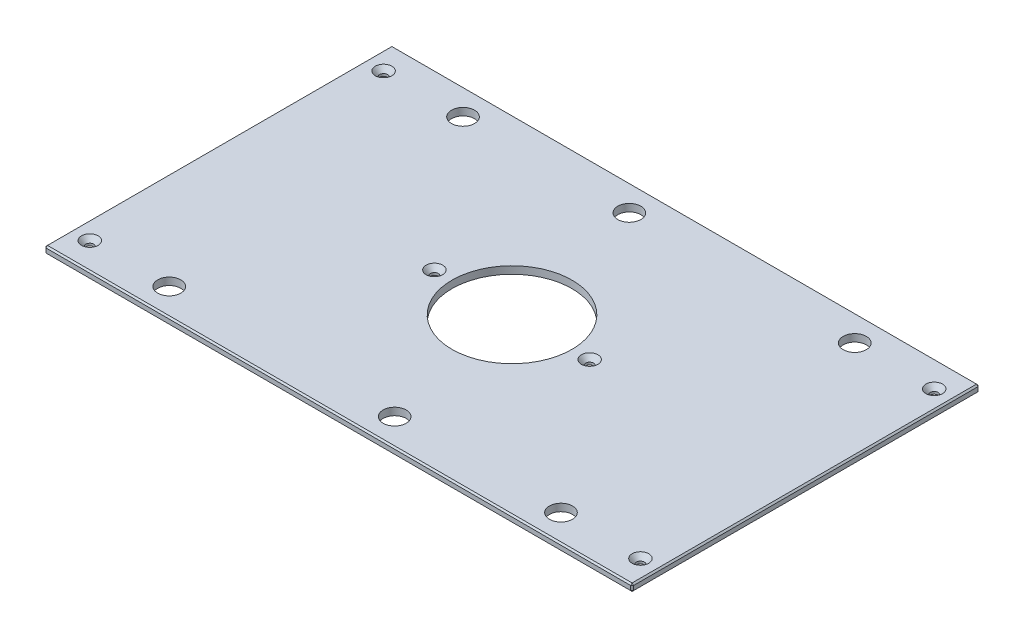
ISO-10303-21;
HEADER;
FILE_DESCRIPTION(('STEP AP214'),'2;1');
FILE_NAME('part.step','',(''),(''),'','','');
FILE_SCHEMA(('AUTOMOTIVE_DESIGN { 1 0 10303 214 1 1 1 1 }'));
ENDSEC;
DATA;
#1=APPLICATION_CONTEXT('core data for automotive mechanical design processes');
#2=APPLICATION_PROTOCOL_DEFINITION('international standard','automotive_design',2000,#1);
#3=PRODUCT_CONTEXT('',#1,'mechanical');
#4=PRODUCT('Part','Part','',(#3));
#5=PRODUCT_RELATED_PRODUCT_CATEGORY('part','',(#4));
#6=PRODUCT_DEFINITION_FORMATION('','',#4);
#7=PRODUCT_DEFINITION_CONTEXT('part definition',#1,'design');
#8=PRODUCT_DEFINITION('design','',#6,#7);
#9=PRODUCT_DEFINITION_SHAPE('','',#8);
#10=(LENGTH_UNIT() NAMED_UNIT(*) SI_UNIT(.MILLI.,.METRE.));
#11=(NAMED_UNIT(*) PLANE_ANGLE_UNIT() SI_UNIT($,.RADIAN.));
#12=(NAMED_UNIT(*) SI_UNIT($,.STERADIAN.) SOLID_ANGLE_UNIT());
#13=UNCERTAINTY_MEASURE_WITH_UNIT(LENGTH_MEASURE(1.E-05),#10,'distance_accuracy_value','');
#14=(GEOMETRIC_REPRESENTATION_CONTEXT(3) GLOBAL_UNCERTAINTY_ASSIGNED_CONTEXT((#13)) GLOBAL_UNIT_ASSIGNED_CONTEXT((#10,
#11,#12)) REPRESENTATION_CONTEXT('',''));
#15=CARTESIAN_POINT('',(0.,0.,0.));
#16=DIRECTION('',(0.,0.,1.));
#17=DIRECTION('',(1.,0.,0.));
#18=AXIS2_PLACEMENT_3D('',#15,#16,#17);
#19=CARTESIAN_POINT('',(-252.4125,6.35,-149.225));
#20=DIRECTION('',(1.,0.,0.));
#21=DIRECTION('',(0.,0.,-1.));
#22=AXIS2_PLACEMENT_3D('',#19,#20,#21);
#23=PLANE('',#22);
#24=DIRECTION('',(0.,0.,-1.));
#25=VECTOR('',#24,1.);
#26=CARTESIAN_POINT('',(-252.4125,5.08000000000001,-149.225));
#27=LINE('',#26,#25);
#28=CARTESIAN_POINT('',(-252.4125,5.08000000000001,147.955));
#29=VERTEX_POINT('',#28);
#30=CARTESIAN_POINT('',(-252.4125,5.08000000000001,-147.955));
#31=VERTEX_POINT('',#30);
#32=EDGE_CURVE('E140',#29,#31,#27,.T.);
#33=ORIENTED_EDGE('',*,*,#32,.T.);
#34=DIRECTION('',(0.,-1.,0.));
#35=VECTOR('',#34,1.);
#36=CARTESIAN_POINT('',(-252.4125,6.35,-147.955));
#37=LINE('',#36,#35);
#38=CARTESIAN_POINT('',(-252.4125,1.26999999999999,-147.955));
#39=VERTEX_POINT('',#38);
#40=EDGE_CURVE('E135',#31,#39,#37,.T.);
#41=ORIENTED_EDGE('',*,*,#40,.T.);
#42=DIRECTION('',(0.,0.,1.));
#43=VECTOR('',#42,1.);
#44=CARTESIAN_POINT('',(-252.4125,1.26999999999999,-149.225));
#45=LINE('',#44,#43);
#46=CARTESIAN_POINT('',(-252.4125,1.26999999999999,147.955));
#47=VERTEX_POINT('',#46);
#48=EDGE_CURVE('E130',#39,#47,#45,.T.);
#49=ORIENTED_EDGE('',*,*,#48,.T.);
#50=DIRECTION('',(0.,1.,0.));
#51=VECTOR('',#50,1.);
#52=CARTESIAN_POINT('',(-252.4125,6.35,147.955));
#53=LINE('',#52,#51);
#54=EDGE_CURVE('E132',#47,#29,#53,.T.);
#55=ORIENTED_EDGE('',*,*,#54,.T.);
#56=EDGE_LOOP('',(#33,#41,#49,#55));
#57=FACE_BOUND('',#56,.T.);
#58=ADVANCED_FACE('F38',(#57),#23,.F.);
#59=CARTESIAN_POINT('',(-252.4125,6.35,149.225));
#60=DIRECTION('',(0.,0.,-1.));
#61=DIRECTION('',(-1.,0.,0.));
#62=AXIS2_PLACEMENT_3D('',#59,#60,#61);
#63=PLANE('',#62);
#64=DIRECTION('',(1.,0.,0.));
#65=VECTOR('',#64,1.);
#66=CARTESIAN_POINT('',(-252.4125,1.27000000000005,149.225));
#67=LINE('',#66,#65);
#68=CARTESIAN_POINT('',(-251.1425,1.27000000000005,149.225));
#69=VERTEX_POINT('',#68);
#70=CARTESIAN_POINT('',(251.1425,1.27000000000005,149.225));
#71=VERTEX_POINT('',#70);
#72=EDGE_CURVE('E62',#69,#71,#67,.T.);
#73=ORIENTED_EDGE('',*,*,#72,.T.);
#74=DIRECTION('',(0.,1.,0.));
#75=VECTOR('',#74,1.);
#76=CARTESIAN_POINT('',(251.1425,6.35,149.225));
#77=LINE('',#76,#75);
#78=CARTESIAN_POINT('',(251.1425,5.07999999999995,149.225));
#79=VERTEX_POINT('',#78);
#80=EDGE_CURVE('E11',#71,#79,#77,.T.);
#81=ORIENTED_EDGE('',*,*,#80,.T.);
#82=DIRECTION('',(-1.,0.,0.));
#83=VECTOR('',#82,1.);
#84=CARTESIAN_POINT('',(-252.4125,5.07999999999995,149.225));
#85=LINE('',#84,#83);
#86=CARTESIAN_POINT('',(-251.1425,5.07999999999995,149.225));
#87=VERTEX_POINT('',#86);
#88=EDGE_CURVE('E48',#79,#87,#85,.T.);
#89=ORIENTED_EDGE('',*,*,#88,.T.);
#90=DIRECTION('',(0.,-1.,0.));
#91=VECTOR('',#90,1.);
#92=CARTESIAN_POINT('',(-251.1425,6.35,149.225));
#93=LINE('',#92,#91);
#94=EDGE_CURVE('E350',#87,#69,#93,.T.);
#95=ORIENTED_EDGE('',*,*,#94,.T.);
#96=EDGE_LOOP('',(#73,#81,#89,#95));
#97=FACE_BOUND('',#96,.T.);
#98=ADVANCED_FACE('F427',(#97),#63,.F.);
#99=CARTESIAN_POINT('',(252.4125,6.35,-149.225));
#100=DIRECTION('',(-1.,0.,0.));
#101=DIRECTION('',(0.,0.,1.));
#102=AXIS2_PLACEMENT_3D('',#99,#100,#101);
#103=PLANE('',#102);
#104=DIRECTION('',(0.,0.,-1.));
#105=VECTOR('',#104,1.);
#106=CARTESIAN_POINT('',(252.4125,1.27000000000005,-149.225));
#107=LINE('',#106,#105);
#108=CARTESIAN_POINT('',(252.4125,1.27000000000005,147.955));
#109=VERTEX_POINT('',#108);
#110=CARTESIAN_POINT('',(252.4125,1.27000000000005,-147.955));
#111=VERTEX_POINT('',#110);
#112=EDGE_CURVE('E343',#109,#111,#107,.T.);
#113=ORIENTED_EDGE('',*,*,#112,.T.);
#114=DIRECTION('',(0.,1.,0.));
#115=VECTOR('',#114,1.);
#116=CARTESIAN_POINT('',(252.4125,6.35,-147.955));
#117=LINE('',#116,#115);
#118=CARTESIAN_POINT('',(252.4125,5.08000000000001,-147.955));
#119=VERTEX_POINT('',#118);
#120=EDGE_CURVE('E346',#111,#119,#117,.T.);
#121=ORIENTED_EDGE('',*,*,#120,.T.);
#122=DIRECTION('',(0.,0.,1.));
#123=VECTOR('',#122,1.);
#124=CARTESIAN_POINT('',(252.4125,5.08000000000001,149.225));
#125=LINE('',#124,#123);
#126=CARTESIAN_POINT('',(252.4125,5.08000000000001,147.955));
#127=VERTEX_POINT('',#126);
#128=EDGE_CURVE('E340',#119,#127,#125,.T.);
#129=ORIENTED_EDGE('',*,*,#128,.T.);
#130=DIRECTION('',(0.,-1.,0.));
#131=VECTOR('',#130,1.);
#132=CARTESIAN_POINT('',(252.4125,6.35,147.955));
#133=LINE('',#132,#131);
#134=EDGE_CURVE('E337',#127,#109,#133,.T.);
#135=ORIENTED_EDGE('',*,*,#134,.T.);
#136=EDGE_LOOP('',(#113,#121,#129,#135));
#137=FACE_BOUND('',#136,.T.);
#138=ADVANCED_FACE('F414',(#137),#103,.F.);
#139=CARTESIAN_POINT('',(-252.4125,6.35,-149.225));
#140=DIRECTION('',(0.,0.,1.));
#141=DIRECTION('',(1.,0.,0.));
#142=AXIS2_PLACEMENT_3D('',#139,#140,#141);
#143=PLANE('',#142);
#144=DIRECTION('',(-1.,0.,0.));
#145=VECTOR('',#144,1.);
#146=CARTESIAN_POINT('',(-252.4125,1.27000000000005,-149.225));
#147=LINE('',#146,#145);
#148=CARTESIAN_POINT('',(251.1425,1.27000000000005,-149.225));
#149=VERTEX_POINT('',#148);
#150=CARTESIAN_POINT('',(-251.1425,1.27000000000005,-149.225));
#151=VERTEX_POINT('',#150);
#152=EDGE_CURVE('E303',#149,#151,#147,.T.);
#153=ORIENTED_EDGE('',*,*,#152,.T.);
#154=DIRECTION('',(0.,1.,0.));
#155=VECTOR('',#154,1.);
#156=CARTESIAN_POINT('',(-251.1425,6.35,-149.225));
#157=LINE('',#156,#155);
#158=CARTESIAN_POINT('',(-251.1425,5.08000000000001,-149.225));
#159=VERTEX_POINT('',#158);
#160=EDGE_CURVE('E309',#151,#159,#157,.T.);
#161=ORIENTED_EDGE('',*,*,#160,.T.);
#162=DIRECTION('',(1.,0.,0.));
#163=VECTOR('',#162,1.);
#164=CARTESIAN_POINT('',(252.4125,5.08000000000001,-149.225));
#165=LINE('',#164,#163);
#166=CARTESIAN_POINT('',(251.1425,5.08000000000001,-149.225));
#167=VERTEX_POINT('',#166);
#168=EDGE_CURVE('E306',#159,#167,#165,.T.);
#169=ORIENTED_EDGE('',*,*,#168,.T.);
#170=DIRECTION('',(0.,-1.,0.));
#171=VECTOR('',#170,1.);
#172=CARTESIAN_POINT('',(251.1425,6.35,-149.225));
#173=LINE('',#172,#171);
#174=EDGE_CURVE('E300',#167,#149,#173,.T.);
#175=ORIENTED_EDGE('',*,*,#174,.T.);
#176=EDGE_LOOP('',(#153,#161,#169,#175));
#177=FACE_BOUND('',#176,.T.);
#178=ADVANCED_FACE('F388',(#177),#143,.F.);
#179=CARTESIAN_POINT('',(0.,6.35,0.));
#180=DIRECTION('',(0.,1.,0.));
#181=DIRECTION('',(0.,0.,1.));
#182=AXIS2_PLACEMENT_3D('',#179,#180,#181);
#183=PLANE('',#182);
#184=CARTESIAN_POINT('',(236.5375,6.35,-126.20498));
#185=DIRECTION('',(0.,1.,0.));
#186=DIRECTION('',(0.,0.,1.));
#187=AXIS2_PLACEMENT_3D('',#184,#185,#186);
#188=CIRCLE('',#187,7.13739999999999);
#189=CARTESIAN_POINT('',(236.5375,6.35,-119.06758));
#190=VERTEX_POINT('',#189);
#191=EDGE_CURVE('E927',#190,#190,#188,.T.);
#192=ORIENTED_EDGE('',*,*,#191,.F.);
#193=EDGE_LOOP('',(#192));
#194=FACE_BOUND('',#193,.T.);
#195=CARTESIAN_POINT('',(236.5375,6.35,126.20498));
#196=DIRECTION('',(0.,1.,0.));
#197=DIRECTION('',(0.,0.,1.));
#198=AXIS2_PLACEMENT_3D('',#195,#196,#197);
#199=CIRCLE('',#198,7.13739999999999);
#200=CARTESIAN_POINT('',(236.5375,6.35,133.34238));
#201=VERTEX_POINT('',#200);
#202=EDGE_CURVE('E931',#201,#201,#199,.T.);
#203=ORIENTED_EDGE('',*,*,#202,.F.);
#204=EDGE_LOOP('',(#203));
#205=FACE_BOUND('',#204,.T.);
#206=CARTESIAN_POINT('',(-236.5375,6.35,126.20498));
#207=DIRECTION('',(0.,1.,0.));
#208=DIRECTION('',(0.,0.,1.));
#209=AXIS2_PLACEMENT_3D('',#206,#207,#208);
#210=CIRCLE('',#209,7.13739999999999);
#211=CARTESIAN_POINT('',(-236.5375,6.35,133.34238));
#212=VERTEX_POINT('',#211);
#213=EDGE_CURVE('E935',#212,#212,#210,.T.);
#214=ORIENTED_EDGE('',*,*,#213,.F.);
#215=EDGE_LOOP('',(#214));
#216=FACE_BOUND('',#215,.T.);
#217=CARTESIAN_POINT('',(-66.675,6.35,0.));
#218=DIRECTION('',(0.,1.,0.));
#219=DIRECTION('',(0.,0.,1.));
#220=AXIS2_PLACEMENT_3D('',#217,#218,#219);
#221=CIRCLE('',#220,7.1374);
#222=CARTESIAN_POINT('',(-66.675,6.35,7.1374));
#223=VERTEX_POINT('',#222);
#224=EDGE_CURVE('E939',#223,#223,#221,.T.);
#225=ORIENTED_EDGE('',*,*,#224,.F.);
#226=EDGE_LOOP('',(#225));
#227=FACE_BOUND('',#226,.T.);
#228=CARTESIAN_POINT('',(66.675,6.35,0.));
#229=DIRECTION('',(0.,1.,0.));
#230=DIRECTION('',(0.,0.,1.));
#231=AXIS2_PLACEMENT_3D('',#228,#229,#230);
#232=CIRCLE('',#231,7.1374);
#233=CARTESIAN_POINT('',(66.675,6.35,7.1374));
#234=VERTEX_POINT('',#233);
#235=EDGE_CURVE('E943',#234,#234,#232,.T.);
#236=ORIENTED_EDGE('',*,*,#235,.F.);
#237=EDGE_LOOP('',(#236));
#238=FACE_BOUND('',#237,.T.);
#239=CARTESIAN_POINT('',(-236.5375,6.35,-126.20498));
#240=DIRECTION('',(0.,1.,0.));
#241=DIRECTION('',(0.,0.,1.));
#242=AXIS2_PLACEMENT_3D('',#239,#240,#241);
#243=CIRCLE('',#242,7.13739999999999);
#244=CARTESIAN_POINT('',(-236.5375,6.35,-119.06758));
#245=VERTEX_POINT('',#244);
#246=EDGE_CURVE('E946',#245,#245,#243,.T.);
#247=ORIENTED_EDGE('',*,*,#246,.F.);
#248=EDGE_LOOP('',(#247));
#249=FACE_BOUND('',#248,.T.);
#250=DIRECTION('',(0.,0.,-1.));
#251=VECTOR('',#250,1.);
#252=CARTESIAN_POINT('',(251.1425,6.35,-149.225));
#253=LINE('',#252,#251);
#254=CARTESIAN_POINT('',(251.1425,6.35,147.955));
#255=VERTEX_POINT('',#254);
#256=CARTESIAN_POINT('',(251.1425,6.35,-147.955));
#257=VERTEX_POINT('',#256);
#258=EDGE_CURVE('E319',#255,#257,#253,.T.);
#259=ORIENTED_EDGE('',*,*,#258,.T.);
#260=DIRECTION('',(-1.,0.,0.));
#261=VECTOR('',#260,1.);
#262=CARTESIAN_POINT('',(-252.4125,6.35,-147.955));
#263=LINE('',#262,#261);
#264=CARTESIAN_POINT('',(-251.1425,6.35,-147.955));
#265=VERTEX_POINT('',#264);
#266=EDGE_CURVE('E322',#257,#265,#263,.T.);
#267=ORIENTED_EDGE('',*,*,#266,.T.);
#268=DIRECTION('',(0.,0.,1.));
#269=VECTOR('',#268,1.);
#270=CARTESIAN_POINT('',(-251.1425,6.35,149.225));
#271=LINE('',#270,#269);
#272=CARTESIAN_POINT('',(-251.1425,6.35,147.955));
#273=VERTEX_POINT('',#272);
#274=EDGE_CURVE('E316',#265,#273,#271,.T.);
#275=ORIENTED_EDGE('',*,*,#274,.T.);
#276=DIRECTION('',(1.,0.,0.));
#277=VECTOR('',#276,1.);
#278=CARTESIAN_POINT('',(252.4125,6.35,147.955));
#279=LINE('',#278,#277);
#280=EDGE_CURVE('E313',#273,#255,#279,.T.);
#281=ORIENTED_EDGE('',*,*,#280,.T.);
#282=EDGE_LOOP('',(#259,#267,#275,#281));
#283=FACE_BOUND('',#282,.T.);
#284=CARTESIAN_POINT('',(168.275,6.35,-126.20498));
#285=DIRECTION('',(0.,1.,0.));
#286=DIRECTION('',(0.,0.,1.));
#287=AXIS2_PLACEMENT_3D('',#284,#285,#286);
#288=CIRCLE('',#287,9.921875);
#289=CARTESIAN_POINT('',(168.275,6.35,-116.283105));
#290=VERTEX_POINT('',#289);
#291=EDGE_CURVE('E231',#290,#290,#288,.T.);
#292=ORIENTED_EDGE('',*,*,#291,.F.);
#293=EDGE_LOOP('',(#292));
#294=FACE_BOUND('',#293,.T.);
#295=CARTESIAN_POINT('',(-168.275,6.35,-126.20498));
#296=DIRECTION('',(0.,1.,0.));
#297=DIRECTION('',(0.,0.,1.));
#298=AXIS2_PLACEMENT_3D('',#295,#296,#297);
#299=CIRCLE('',#298,9.921875);
#300=CARTESIAN_POINT('',(-168.275,6.35,-116.283105));
#301=VERTEX_POINT('',#300);
#302=EDGE_CURVE('E244',#301,#301,#299,.T.);
#303=ORIENTED_EDGE('',*,*,#302,.F.);
#304=EDGE_LOOP('',(#303));
#305=FACE_BOUND('',#304,.T.);
#306=CARTESIAN_POINT('',(168.275,6.35,126.20498));
#307=DIRECTION('',(0.,1.,0.));
#308=DIRECTION('',(0.,0.,1.));
#309=AXIS2_PLACEMENT_3D('',#306,#307,#308);
#310=CIRCLE('',#309,9.921875);
#311=CARTESIAN_POINT('',(168.275,6.35,136.126855));
#312=VERTEX_POINT('',#311);
#313=EDGE_CURVE('E257',#312,#312,#310,.T.);
#314=ORIENTED_EDGE('',*,*,#313,.F.);
#315=EDGE_LOOP('',(#314));
#316=FACE_BOUND('',#315,.T.);
#317=CARTESIAN_POINT('',(-168.275,6.35,126.20498));
#318=DIRECTION('',(0.,1.,0.));
#319=DIRECTION('',(0.,0.,1.));
#320=AXIS2_PLACEMENT_3D('',#317,#318,#319);
#321=CIRCLE('',#320,9.921875);
#322=CARTESIAN_POINT('',(-168.275,6.35,136.126855));
#323=VERTEX_POINT('',#322);
#324=EDGE_CURVE('E265',#323,#323,#321,.T.);
#325=ORIENTED_EDGE('',*,*,#324,.F.);
#326=EDGE_LOOP('',(#325));
#327=FACE_BOUND('',#326,.T.);
#328=CARTESIAN_POINT('',(-25.4,6.35,-126.20498));
#329=DIRECTION('',(0.,1.,0.));
#330=DIRECTION('',(0.,0.,1.));
#331=AXIS2_PLACEMENT_3D('',#328,#329,#330);
#332=CIRCLE('',#331,9.921875);
#333=CARTESIAN_POINT('',(-25.4,6.35,-116.283105));
#334=VERTEX_POINT('',#333);
#335=EDGE_CURVE('E273',#334,#334,#332,.T.);
#336=ORIENTED_EDGE('',*,*,#335,.F.);
#337=EDGE_LOOP('',(#336));
#338=FACE_BOUND('',#337,.T.);
#339=CARTESIAN_POINT('',(25.4,6.35,126.20498));
#340=DIRECTION('',(0.,1.,0.));
#341=DIRECTION('',(0.,0.,1.));
#342=AXIS2_PLACEMENT_3D('',#339,#340,#341);
#343=CIRCLE('',#342,9.921875);
#344=CARTESIAN_POINT('',(25.4,6.35,136.126855));
#345=VERTEX_POINT('',#344);
#346=EDGE_CURVE('E281',#345,#345,#343,.T.);
#347=ORIENTED_EDGE('',*,*,#346,.F.);
#348=EDGE_LOOP('',(#347));
#349=FACE_BOUND('',#348,.T.);
#350=CARTESIAN_POINT('',(0.,6.35,0.));
#351=DIRECTION('',(0.,1.,0.));
#352=DIRECTION('',(0.,0.,1.));
#353=AXIS2_PLACEMENT_3D('',#350,#351,#352);
#354=CIRCLE('',#353,51.562);
#355=CARTESIAN_POINT('',(0.,6.35,51.562));
#356=VERTEX_POINT('',#355);
#357=EDGE_CURVE('E289',#356,#356,#354,.T.);
#358=ORIENTED_EDGE('',*,*,#357,.F.);
#359=EDGE_LOOP('',(#358));
#360=FACE_BOUND('',#359,.T.);
#361=ADVANCED_FACE('F436',(#194,#205,#216,#227,#238,#249,#283,#294,#305,#316,#327,#338,#349,
#360),#183,.T.);
#362=CARTESIAN_POINT('',(0.,0.,0.));
#363=DIRECTION('',(0.,1.,0.));
#364=DIRECTION('',(0.,0.,1.));
#365=AXIS2_PLACEMENT_3D('',#362,#363,#364);
#366=PLANE('',#365);
#367=CARTESIAN_POINT('',(236.5375,0.,-126.20498));
#368=DIRECTION('',(0.,1.,0.));
#369=DIRECTION('',(0.,0.,1.));
#370=AXIS2_PLACEMENT_3D('',#367,#368,#369);
#371=CIRCLE('',#370,3.3782);
#372=CARTESIAN_POINT('',(236.5375,0.,-122.82678));
#373=VERTEX_POINT('',#372);
#374=EDGE_CURVE('E992',#373,#373,#371,.T.);
#375=ORIENTED_EDGE('',*,*,#374,.T.);
#376=EDGE_LOOP('',(#375));
#377=FACE_BOUND('',#376,.T.);
#378=CARTESIAN_POINT('',(236.5375,0.,126.20498));
#379=DIRECTION('',(0.,1.,0.));
#380=DIRECTION('',(0.,0.,1.));
#381=AXIS2_PLACEMENT_3D('',#378,#379,#380);
#382=CIRCLE('',#381,3.3782);
#383=CARTESIAN_POINT('',(236.5375,0.,129.58318));
#384=VERTEX_POINT('',#383);
#385=EDGE_CURVE('E982',#384,#384,#382,.T.);
#386=ORIENTED_EDGE('',*,*,#385,.T.);
#387=EDGE_LOOP('',(#386));
#388=FACE_BOUND('',#387,.T.);
#389=CARTESIAN_POINT('',(-236.5375,0.,126.20498));
#390=DIRECTION('',(0.,1.,0.));
#391=DIRECTION('',(0.,0.,1.));
#392=AXIS2_PLACEMENT_3D('',#389,#390,#391);
#393=CIRCLE('',#392,3.3782);
#394=CARTESIAN_POINT('',(-236.5375,0.,129.58318));
#395=VERTEX_POINT('',#394);
#396=EDGE_CURVE('E973',#395,#395,#393,.T.);
#397=ORIENTED_EDGE('',*,*,#396,.T.);
#398=EDGE_LOOP('',(#397));
#399=FACE_BOUND('',#398,.T.);
#400=CARTESIAN_POINT('',(-66.675,0.,0.));
#401=DIRECTION('',(0.,1.,0.));
#402=DIRECTION('',(0.,0.,1.));
#403=AXIS2_PLACEMENT_3D('',#400,#401,#402);
#404=CIRCLE('',#403,3.3782);
#405=CARTESIAN_POINT('',(-66.675,0.,3.3782));
#406=VERTEX_POINT('',#405);
#407=EDGE_CURVE('E964',#406,#406,#404,.T.);
#408=ORIENTED_EDGE('',*,*,#407,.T.);
#409=EDGE_LOOP('',(#408));
#410=FACE_BOUND('',#409,.T.);
#411=CARTESIAN_POINT('',(66.675,0.,0.));
#412=DIRECTION('',(0.,1.,0.));
#413=DIRECTION('',(0.,0.,1.));
#414=AXIS2_PLACEMENT_3D('',#411,#412,#413);
#415=CIRCLE('',#414,3.3782);
#416=CARTESIAN_POINT('',(66.675,0.,3.3782));
#417=VERTEX_POINT('',#416);
#418=EDGE_CURVE('E950',#417,#417,#415,.T.);
#419=ORIENTED_EDGE('',*,*,#418,.T.);
#420=EDGE_LOOP('',(#419));
#421=FACE_BOUND('',#420,.T.);
#422=CARTESIAN_POINT('',(-236.5375,0.,-126.20498));
#423=DIRECTION('',(0.,1.,0.));
#424=DIRECTION('',(0.,0.,1.));
#425=AXIS2_PLACEMENT_3D('',#422,#423,#424);
#426=CIRCLE('',#425,3.3782);
#427=CARTESIAN_POINT('',(-236.5375,0.,-122.82678));
#428=VERTEX_POINT('',#427);
#429=EDGE_CURVE('E247',#428,#428,#426,.T.);
#430=ORIENTED_EDGE('',*,*,#429,.T.);
#431=EDGE_LOOP('',(#430));
#432=FACE_BOUND('',#431,.T.);
#433=DIRECTION('',(0.,0.,-1.));
#434=VECTOR('',#433,1.);
#435=CARTESIAN_POINT('',(-251.1425,0.,0.));
#436=LINE('',#435,#434);
#437=CARTESIAN_POINT('',(-251.1425,0.,147.955));
#438=VERTEX_POINT('',#437);
#439=CARTESIAN_POINT('',(-251.1425,0.,-147.955));
#440=VERTEX_POINT('',#439);
#441=EDGE_CURVE('E165',#438,#440,#436,.T.);
#442=ORIENTED_EDGE('',*,*,#441,.T.);
#443=DIRECTION('',(1.,0.,0.));
#444=VECTOR('',#443,1.);
#445=CARTESIAN_POINT('',(0.,0.,-147.955));
#446=LINE('',#445,#444);
#447=CARTESIAN_POINT('',(251.1425,0.,-147.955));
#448=VERTEX_POINT('',#447);
#449=EDGE_CURVE('E333',#440,#448,#446,.T.);
#450=ORIENTED_EDGE('',*,*,#449,.T.);
#451=DIRECTION('',(0.,0.,1.));
#452=VECTOR('',#451,1.);
#453=CARTESIAN_POINT('',(251.1425,0.,0.));
#454=LINE('',#453,#452);
#455=CARTESIAN_POINT('',(251.1425,0.,147.955));
#456=VERTEX_POINT('',#455);
#457=EDGE_CURVE('E331',#448,#456,#454,.T.);
#458=ORIENTED_EDGE('',*,*,#457,.T.);
#459=DIRECTION('',(-1.,0.,0.));
#460=VECTOR('',#459,1.);
#461=CARTESIAN_POINT('',(0.,0.,147.955));
#462=LINE('',#461,#460);
#463=EDGE_CURVE('E326',#456,#438,#462,.T.);
#464=ORIENTED_EDGE('',*,*,#463,.T.);
#465=EDGE_LOOP('',(#442,#450,#458,#464));
#466=FACE_BOUND('',#465,.T.);
#467=CARTESIAN_POINT('',(168.275,0.,-126.20498));
#468=DIRECTION('',(0.,1.,0.));
#469=DIRECTION('',(0.,0.,1.));
#470=AXIS2_PLACEMENT_3D('',#467,#468,#469);
#471=CIRCLE('',#470,9.921875);
#472=CARTESIAN_POINT('',(168.275,0.,-116.283105));
#473=VERTEX_POINT('',#472);
#474=EDGE_CURVE('E237',#473,#473,#471,.T.);
#475=ORIENTED_EDGE('',*,*,#474,.T.);
#476=EDGE_LOOP('',(#475));
#477=FACE_BOUND('',#476,.T.);
#478=CARTESIAN_POINT('',(-168.275,0.,-126.20498));
#479=DIRECTION('',(0.,1.,0.));
#480=DIRECTION('',(0.,0.,1.));
#481=AXIS2_PLACEMENT_3D('',#478,#479,#480);
#482=CIRCLE('',#481,9.921875);
#483=CARTESIAN_POINT('',(-168.275,0.,-116.283105));
#484=VERTEX_POINT('',#483);
#485=EDGE_CURVE('E253',#484,#484,#482,.T.);
#486=ORIENTED_EDGE('',*,*,#485,.T.);
#487=EDGE_LOOP('',(#486));
#488=FACE_BOUND('',#487,.T.);
#489=CARTESIAN_POINT('',(168.275,0.,126.20498));
#490=DIRECTION('',(0.,1.,0.));
#491=DIRECTION('',(0.,0.,1.));
#492=AXIS2_PLACEMENT_3D('',#489,#490,#491);
#493=CIRCLE('',#492,9.921875);
#494=CARTESIAN_POINT('',(168.275,0.,136.126855));
#495=VERTEX_POINT('',#494);
#496=EDGE_CURVE('E261',#495,#495,#493,.T.);
#497=ORIENTED_EDGE('',*,*,#496,.T.);
#498=EDGE_LOOP('',(#497));
#499=FACE_BOUND('',#498,.T.);
#500=CARTESIAN_POINT('',(-168.275,0.,126.20498));
#501=DIRECTION('',(0.,1.,0.));
#502=DIRECTION('',(0.,0.,1.));
#503=AXIS2_PLACEMENT_3D('',#500,#501,#502);
#504=CIRCLE('',#503,9.921875);
#505=CARTESIAN_POINT('',(-168.275,0.,136.126855));
#506=VERTEX_POINT('',#505);
#507=EDGE_CURVE('E269',#506,#506,#504,.T.);
#508=ORIENTED_EDGE('',*,*,#507,.T.);
#509=EDGE_LOOP('',(#508));
#510=FACE_BOUND('',#509,.T.);
#511=CARTESIAN_POINT('',(-25.4,0.,-126.20498));
#512=DIRECTION('',(0.,1.,0.));
#513=DIRECTION('',(0.,0.,1.));
#514=AXIS2_PLACEMENT_3D('',#511,#512,#513);
#515=CIRCLE('',#514,9.921875);
#516=CARTESIAN_POINT('',(-25.4,0.,-116.283105));
#517=VERTEX_POINT('',#516);
#518=EDGE_CURVE('E277',#517,#517,#515,.T.);
#519=ORIENTED_EDGE('',*,*,#518,.T.);
#520=EDGE_LOOP('',(#519));
#521=FACE_BOUND('',#520,.T.);
#522=CARTESIAN_POINT('',(25.4,0.,126.20498));
#523=DIRECTION('',(0.,1.,0.));
#524=DIRECTION('',(0.,0.,1.));
#525=AXIS2_PLACEMENT_3D('',#522,#523,#524);
#526=CIRCLE('',#525,9.921875);
#527=CARTESIAN_POINT('',(25.4,0.,136.126855));
#528=VERTEX_POINT('',#527);
#529=EDGE_CURVE('E285',#528,#528,#526,.T.);
#530=ORIENTED_EDGE('',*,*,#529,.T.);
#531=EDGE_LOOP('',(#530));
#532=FACE_BOUND('',#531,.T.);
#533=CARTESIAN_POINT('',(0.,0.,0.));
#534=DIRECTION('',(0.,1.,0.));
#535=DIRECTION('',(0.,0.,1.));
#536=AXIS2_PLACEMENT_3D('',#533,#534,#535);
#537=CIRCLE('',#536,51.562);
#538=CARTESIAN_POINT('',(0.,0.,51.562));
#539=VERTEX_POINT('',#538);
#540=EDGE_CURVE('E153',#539,#539,#537,.T.);
#541=ORIENTED_EDGE('',*,*,#540,.T.);
#542=EDGE_LOOP('',(#541));
#543=FACE_BOUND('',#542,.T.);
#544=ADVANCED_FACE('F401',(#377,#388,#399,#410,#421,#432,#466,#477,#488,#499,#510,#521,#532,
#543),#366,.F.);
#545=CARTESIAN_POINT('',(0.,0.,0.));
#546=DIRECTION('',(0.,1.,0.));
#547=DIRECTION('',(0.,0.,1.));
#548=AXIS2_PLACEMENT_3D('',#545,#546,#547);
#549=CYLINDRICAL_SURFACE('',#548,51.562);
#550=ORIENTED_EDGE('',*,*,#540,.F.);
#551=EDGE_LOOP('',(#550));
#552=FACE_BOUND('',#551,.T.);
#553=ORIENTED_EDGE('',*,*,#357,.T.);
#554=EDGE_LOOP('',(#553));
#555=FACE_BOUND('',#554,.T.);
#556=ADVANCED_FACE('F682',(#552,#555),#549,.F.);
#557=CARTESIAN_POINT('',(25.4,6.35,126.20498));
#558=DIRECTION('',(0.,1.,0.));
#559=DIRECTION('',(0.,0.,1.));
#560=AXIS2_PLACEMENT_3D('',#557,#558,#559);
#561=CYLINDRICAL_SURFACE('',#560,9.921875);
#562=ORIENTED_EDGE('',*,*,#529,.F.);
#563=EDGE_LOOP('',(#562));
#564=FACE_BOUND('',#563,.T.);
#565=ORIENTED_EDGE('',*,*,#346,.T.);
#566=EDGE_LOOP('',(#565));
#567=FACE_BOUND('',#566,.T.);
#568=ADVANCED_FACE('F856',(#564,#567),#561,.F.);
#569=CARTESIAN_POINT('',(-25.4,6.35,-126.20498));
#570=DIRECTION('',(0.,1.,0.));
#571=DIRECTION('',(0.,0.,1.));
#572=AXIS2_PLACEMENT_3D('',#569,#570,#571);
#573=CYLINDRICAL_SURFACE('',#572,9.921875);
#574=ORIENTED_EDGE('',*,*,#518,.F.);
#575=EDGE_LOOP('',(#574));
#576=FACE_BOUND('',#575,.T.);
#577=ORIENTED_EDGE('',*,*,#335,.T.);
#578=EDGE_LOOP('',(#577));
#579=FACE_BOUND('',#578,.T.);
#580=ADVANCED_FACE('F846',(#576,#579),#573,.F.);
#581=CARTESIAN_POINT('',(-168.275,6.35,126.20498));
#582=DIRECTION('',(0.,1.,0.));
#583=DIRECTION('',(0.,0.,1.));
#584=AXIS2_PLACEMENT_3D('',#581,#582,#583);
#585=CYLINDRICAL_SURFACE('',#584,9.921875);
#586=ORIENTED_EDGE('',*,*,#507,.F.);
#587=EDGE_LOOP('',(#586));
#588=FACE_BOUND('',#587,.T.);
#589=ORIENTED_EDGE('',*,*,#324,.T.);
#590=EDGE_LOOP('',(#589));
#591=FACE_BOUND('',#590,.T.);
#592=ADVANCED_FACE('F836',(#588,#591),#585,.F.);
#593=CARTESIAN_POINT('',(168.275,6.35,126.20498));
#594=DIRECTION('',(0.,1.,0.));
#595=DIRECTION('',(0.,0.,1.));
#596=AXIS2_PLACEMENT_3D('',#593,#594,#595);
#597=CYLINDRICAL_SURFACE('',#596,9.921875);
#598=ORIENTED_EDGE('',*,*,#496,.F.);
#599=EDGE_LOOP('',(#598));
#600=FACE_BOUND('',#599,.T.);
#601=ORIENTED_EDGE('',*,*,#313,.T.);
#602=EDGE_LOOP('',(#601));
#603=FACE_BOUND('',#602,.T.);
#604=ADVANCED_FACE('F826',(#600,#603),#597,.F.);
#605=CARTESIAN_POINT('',(-168.275,6.35,-126.20498));
#606=DIRECTION('',(0.,1.,0.));
#607=DIRECTION('',(0.,0.,1.));
#608=AXIS2_PLACEMENT_3D('',#605,#606,#607);
#609=CYLINDRICAL_SURFACE('',#608,9.921875);
#610=ORIENTED_EDGE('',*,*,#485,.F.);
#611=EDGE_LOOP('',(#610));
#612=FACE_BOUND('',#611,.T.);
#613=ORIENTED_EDGE('',*,*,#302,.T.);
#614=EDGE_LOOP('',(#613));
#615=FACE_BOUND('',#614,.T.);
#616=ADVANCED_FACE('F816',(#612,#615),#609,.F.);
#617=CARTESIAN_POINT('',(168.275,6.35,-126.20498));
#618=DIRECTION('',(0.,1.,0.));
#619=DIRECTION('',(0.,0.,1.));
#620=AXIS2_PLACEMENT_3D('',#617,#618,#619);
#621=CYLINDRICAL_SURFACE('',#620,9.921875);
#622=ORIENTED_EDGE('',*,*,#474,.F.);
#623=EDGE_LOOP('',(#622));
#624=FACE_BOUND('',#623,.T.);
#625=ORIENTED_EDGE('',*,*,#291,.T.);
#626=EDGE_LOOP('',(#625));
#627=FACE_BOUND('',#626,.T.);
#628=ADVANCED_FACE('F445',(#624,#627),#621,.F.);
#629=CARTESIAN_POINT('',(252.4125,6.35,147.955));
#630=DIRECTION('',(-0.707106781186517,0.,-0.707106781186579));
#631=DIRECTION('',(0.,-1.,0.));
#632=AXIS2_PLACEMENT_3D('',#629,#630,#631);
#633=PLANE('',#632);
#634=DIRECTION('',(-0.707106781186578,0.,0.707106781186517));
#635=VECTOR('',#634,1.);
#636=CARTESIAN_POINT('',(252.4125,5.08000000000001,147.955));
#637=LINE('',#636,#635);
#638=EDGE_CURVE('E42',#79,#127,#637,.F.);
#639=ORIENTED_EDGE('',*,*,#638,.F.);
#640=ORIENTED_EDGE('',*,*,#80,.F.);
#641=DIRECTION('',(0.707106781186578,0.,-0.707106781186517));
#642=VECTOR('',#641,1.);
#643=CARTESIAN_POINT('',(251.7775,1.27000000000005,148.59));
#644=LINE('',#643,#642);
#645=EDGE_CURVE('E221',#109,#71,#644,.F.);
#646=ORIENTED_EDGE('',*,*,#645,.F.);
#647=ORIENTED_EDGE('',*,*,#134,.F.);
#648=EDGE_LOOP('',(#639,#640,#646,#647));
#649=FACE_BOUND('',#648,.T.);
#650=ADVANCED_FACE('F40',(#649),#633,.F.);
#651=CARTESIAN_POINT('',(252.4125,5.08000000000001,147.955));
#652=DIRECTION('',(0.577350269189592,0.577350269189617,0.577350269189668));
#653=DIRECTION('',(0.,-0.707106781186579,0.707106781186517));
#654=AXIS2_PLACEMENT_3D('',#651,#652,#653);
#655=PLANE('',#654);
#656=DIRECTION('',(0.,-0.707106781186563,0.707106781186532));
#657=VECTOR('',#656,1.);
#658=CARTESIAN_POINT('',(251.1425,5.715,148.59));
#659=LINE('',#658,#657);
#660=EDGE_CURVE('E215',#79,#255,#659,.F.);
#661=ORIENTED_EDGE('',*,*,#660,.F.);
#662=ORIENTED_EDGE('',*,*,#638,.T.);
#663=DIRECTION('',(-0.707106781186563,0.707106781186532,0.));
#664=VECTOR('',#663,1.);
#665=CARTESIAN_POINT('',(252.4125,5.08000000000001,147.955));
#666=LINE('',#665,#664);
#667=EDGE_CURVE('E218',#255,#127,#666,.F.);
#668=ORIENTED_EDGE('',*,*,#667,.F.);
#669=EDGE_LOOP('',(#661,#662,#668));
#670=FACE_BOUND('',#669,.T.);
#671=ADVANCED_FACE('F438',(#670),#655,.T.);
#672=CARTESIAN_POINT('',(251.1425,0.,147.955));
#673=DIRECTION('',(0.577350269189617,-0.577350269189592,0.577350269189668));
#674=DIRECTION('',(0.707106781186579,0.,-0.707106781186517));
#675=AXIS2_PLACEMENT_3D('',#672,#673,#674);
#676=PLANE('',#675);
#677=DIRECTION('',(-0.707106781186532,-0.707106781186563,0.));
#678=VECTOR('',#677,1.);
#679=CARTESIAN_POINT('',(251.1425,0.,147.955));
#680=LINE('',#679,#678);
#681=EDGE_CURVE('E207',#109,#456,#680,.T.);
#682=ORIENTED_EDGE('',*,*,#681,.F.);
#683=ORIENTED_EDGE('',*,*,#645,.T.);
#684=DIRECTION('',(0.,0.707106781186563,0.707106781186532));
#685=VECTOR('',#684,1.);
#686=CARTESIAN_POINT('',(251.1425,0.,147.955));
#687=LINE('',#686,#685);
#688=EDGE_CURVE('E211',#456,#71,#687,.T.);
#689=ORIENTED_EDGE('',*,*,#688,.F.);
#690=EDGE_LOOP('',(#682,#683,#689));
#691=FACE_BOUND('',#690,.T.);
#692=ADVANCED_FACE('F407',(#691),#676,.T.);
#693=CARTESIAN_POINT('',(251.1425,6.35,0.));
#694=DIRECTION('',(0.707106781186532,0.707106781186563,0.));
#695=DIRECTION('',(0.,0.,1.));
#696=AXIS2_PLACEMENT_3D('',#693,#694,#695);
#697=PLANE('',#696);
#698=ORIENTED_EDGE('',*,*,#667,.T.);
#699=ORIENTED_EDGE('',*,*,#128,.F.);
#700=DIRECTION('',(0.707106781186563,-0.707106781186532,0.));
#701=VECTOR('',#700,1.);
#702=CARTESIAN_POINT('',(251.7775,5.71500000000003,-147.955));
#703=LINE('',#702,#701);
#704=EDGE_CURVE('E200',#257,#119,#703,.T.);
#705=ORIENTED_EDGE('',*,*,#704,.F.);
#706=ORIENTED_EDGE('',*,*,#258,.F.);
#707=EDGE_LOOP('',(#698,#699,#705,#706));
#708=FACE_BOUND('',#707,.T.);
#709=ADVANCED_FACE('F424',(#708),#697,.T.);
#710=CARTESIAN_POINT('',(0.,6.35,147.955));
#711=DIRECTION('',(0.,0.707106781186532,0.707106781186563));
#712=DIRECTION('',(-1.,0.,0.));
#713=AXIS2_PLACEMENT_3D('',#710,#711,#712);
#714=PLANE('',#713);
#715=ORIENTED_EDGE('',*,*,#660,.T.);
#716=ORIENTED_EDGE('',*,*,#280,.F.);
#717=DIRECTION('',(0.,0.707106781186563,-0.707106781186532));
#718=VECTOR('',#717,1.);
#719=CARTESIAN_POINT('',(-251.1425,6.35,147.955));
#720=LINE('',#719,#718);
#721=EDGE_CURVE('E196',#87,#273,#720,.T.);
#722=ORIENTED_EDGE('',*,*,#721,.F.);
#723=ORIENTED_EDGE('',*,*,#88,.F.);
#724=EDGE_LOOP('',(#715,#716,#722,#723));
#725=FACE_BOUND('',#724,.T.);
#726=ADVANCED_FACE('F429',(#725),#714,.T.);
#727=CARTESIAN_POINT('',(-251.1425,6.35,149.225));
#728=DIRECTION('',(0.707106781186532,0.,-0.707106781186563));
#729=DIRECTION('',(0.,-1.,0.));
#730=AXIS2_PLACEMENT_3D('',#727,#728,#729);
#731=PLANE('',#730);
#732=DIRECTION('',(0.707106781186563,0.,0.707106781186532));
#733=VECTOR('',#732,1.);
#734=CARTESIAN_POINT('',(-252.4125,1.26999999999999,147.955));
#735=LINE('',#734,#733);
#736=EDGE_CURVE('E147',#69,#47,#735,.F.);
#737=ORIENTED_EDGE('',*,*,#736,.F.);
#738=ORIENTED_EDGE('',*,*,#94,.F.);
#739=DIRECTION('',(-0.707106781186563,0.,-0.707106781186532));
#740=VECTOR('',#739,1.);
#741=CARTESIAN_POINT('',(-251.7775,5.07999999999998,148.59));
#742=LINE('',#741,#740);
#743=EDGE_CURVE('E150',#29,#87,#742,.F.);
#744=ORIENTED_EDGE('',*,*,#743,.F.);
#745=ORIENTED_EDGE('',*,*,#54,.F.);
#746=EDGE_LOOP('',(#737,#738,#744,#745));
#747=FACE_BOUND('',#746,.T.);
#748=ADVANCED_FACE('F145',(#747),#731,.F.);
#749=CARTESIAN_POINT('',(-252.4125,1.27000000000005,149.225));
#750=DIRECTION('',(0.,0.707106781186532,-0.707106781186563));
#751=DIRECTION('',(1.,0.,0.));
#752=AXIS2_PLACEMENT_3D('',#749,#750,#751);
#753=PLANE('',#752);
#754=ORIENTED_EDGE('',*,*,#688,.T.);
#755=ORIENTED_EDGE('',*,*,#72,.F.);
#756=DIRECTION('',(0.,-0.707106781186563,-0.707106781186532));
#757=VECTOR('',#756,1.);
#758=CARTESIAN_POINT('',(-251.1425,0.635000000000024,148.59));
#759=LINE('',#758,#757);
#760=EDGE_CURVE('E161',#438,#69,#759,.F.);
#761=ORIENTED_EDGE('',*,*,#760,.F.);
#762=ORIENTED_EDGE('',*,*,#463,.F.);
#763=EDGE_LOOP('',(#754,#755,#761,#762));
#764=FACE_BOUND('',#763,.T.);
#765=ADVANCED_FACE('F406',(#764),#753,.F.);
#766=CARTESIAN_POINT('',(252.4125,1.27000000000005,-149.225));
#767=DIRECTION('',(-0.707106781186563,0.707106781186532,0.));
#768=DIRECTION('',(0.,0.,-1.));
#769=AXIS2_PLACEMENT_3D('',#766,#767,#768);
#770=PLANE('',#769);
#771=ORIENTED_EDGE('',*,*,#681,.T.);
#772=ORIENTED_EDGE('',*,*,#457,.F.);
#773=DIRECTION('',(0.707106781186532,0.707106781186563,0.));
#774=VECTOR('',#773,1.);
#775=CARTESIAN_POINT('',(251.1425,0.,-147.955));
#776=LINE('',#775,#774);
#777=EDGE_CURVE('E188',#111,#448,#776,.F.);
#778=ORIENTED_EDGE('',*,*,#777,.F.);
#779=ORIENTED_EDGE('',*,*,#112,.F.);
#780=EDGE_LOOP('',(#771,#772,#778,#779));
#781=FACE_BOUND('',#780,.T.);
#782=ADVANCED_FACE('F411',(#781),#770,.F.);
#783=CARTESIAN_POINT('',(251.1425,6.35,-149.225));
#784=DIRECTION('',(-0.707106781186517,0.,0.707106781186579));
#785=DIRECTION('',(0.,-1.,0.));
#786=AXIS2_PLACEMENT_3D('',#783,#784,#785);
#787=PLANE('',#786);
#788=DIRECTION('',(0.707106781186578,0.,0.707106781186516));
#789=VECTOR('',#788,1.);
#790=CARTESIAN_POINT('',(251.1425,5.08000000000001,-149.225));
#791=LINE('',#790,#789);
#792=EDGE_CURVE('E203',#119,#167,#791,.F.);
#793=ORIENTED_EDGE('',*,*,#792,.F.);
#794=ORIENTED_EDGE('',*,*,#120,.F.);
#795=DIRECTION('',(-0.707106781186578,0.,-0.707106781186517));
#796=VECTOR('',#795,1.);
#797=CARTESIAN_POINT('',(251.7775,1.27000000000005,-148.59));
#798=LINE('',#797,#796);
#799=EDGE_CURVE('E184',#149,#111,#798,.F.);
#800=ORIENTED_EDGE('',*,*,#799,.F.);
#801=ORIENTED_EDGE('',*,*,#174,.F.);
#802=EDGE_LOOP('',(#793,#794,#800,#801));
#803=FACE_BOUND('',#802,.T.);
#804=ADVANCED_FACE('F419',(#803),#787,.F.);
#805=CARTESIAN_POINT('',(251.1425,5.08000000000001,-149.225));
#806=DIRECTION('',(0.577350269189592,0.577350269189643,-0.577350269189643));
#807=DIRECTION('',(0.,0.707106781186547,0.707106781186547));
#808=AXIS2_PLACEMENT_3D('',#805,#806,#807);
#809=PLANE('',#808);
#810=ORIENTED_EDGE('',*,*,#704,.T.);
#811=ORIENTED_EDGE('',*,*,#792,.T.);
#812=DIRECTION('',(0.,0.707106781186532,0.707106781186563));
#813=VECTOR('',#812,1.);
#814=CARTESIAN_POINT('',(251.1425,5.08000000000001,-149.225));
#815=LINE('',#814,#813);
#816=EDGE_CURVE('E174',#257,#167,#815,.F.);
#817=ORIENTED_EDGE('',*,*,#816,.F.);
#818=EDGE_LOOP('',(#810,#811,#817));
#819=FACE_BOUND('',#818,.T.);
#820=ADVANCED_FACE('F477',(#819),#809,.T.);
#821=CARTESIAN_POINT('',(-251.1425,6.35,147.955));
#822=DIRECTION('',(-0.577350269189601,0.577350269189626,0.577350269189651));
#823=DIRECTION('',(0.,-0.707106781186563,0.707106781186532));
#824=AXIS2_PLACEMENT_3D('',#821,#822,#823);
#825=PLANE('',#824);
#826=ORIENTED_EDGE('',*,*,#743,.T.);
#827=ORIENTED_EDGE('',*,*,#721,.T.);
#828=DIRECTION('',(-0.707106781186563,-0.707106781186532,0.));
#829=VECTOR('',#828,1.);
#830=CARTESIAN_POINT('',(-251.1425,6.35,147.955));
#831=LINE('',#830,#829);
#832=EDGE_CURVE('E167',#29,#273,#831,.F.);
#833=ORIENTED_EDGE('',*,*,#832,.F.);
#834=EDGE_LOOP('',(#826,#827,#833));
#835=FACE_BOUND('',#834,.T.);
#836=ADVANCED_FACE('F431',(#835),#825,.T.);
#837=CARTESIAN_POINT('',(-252.4125,1.26999999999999,147.955));
#838=DIRECTION('',(-0.577350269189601,-0.577350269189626,0.577350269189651));
#839=DIRECTION('',(0.,-0.707106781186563,-0.707106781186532));
#840=AXIS2_PLACEMENT_3D('',#837,#838,#839);
#841=PLANE('',#840);
#842=ORIENTED_EDGE('',*,*,#760,.T.);
#843=ORIENTED_EDGE('',*,*,#736,.T.);
#844=DIRECTION('',(-0.707106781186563,0.707106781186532,0.));
#845=VECTOR('',#844,1.);
#846=CARTESIAN_POINT('',(-252.4125,1.26999999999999,147.955));
#847=LINE('',#846,#845);
#848=EDGE_CURVE('E158',#438,#47,#847,.T.);
#849=ORIENTED_EDGE('',*,*,#848,.F.);
#850=EDGE_LOOP('',(#842,#843,#849));
#851=FACE_BOUND('',#850,.T.);
#852=ADVANCED_FACE('F157',(#851),#841,.T.);
#853=CARTESIAN_POINT('',(251.1425,0.,-147.955));
#854=DIRECTION('',(0.577350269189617,-0.577350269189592,-0.577350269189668));
#855=DIRECTION('',(-0.707106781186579,0.,-0.707106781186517));
#856=AXIS2_PLACEMENT_3D('',#853,#854,#855);
#857=PLANE('',#856);
#858=ORIENTED_EDGE('',*,*,#799,.T.);
#859=ORIENTED_EDGE('',*,*,#777,.T.);
#860=DIRECTION('',(0.,-0.707106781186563,0.707106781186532));
#861=VECTOR('',#860,1.);
#862=CARTESIAN_POINT('',(251.1425,0.,-147.955));
#863=LINE('',#862,#861);
#864=EDGE_CURVE('E168',#149,#448,#863,.T.);
#865=ORIENTED_EDGE('',*,*,#864,.F.);
#866=EDGE_LOOP('',(#858,#859,#865));
#867=FACE_BOUND('',#866,.T.);
#868=ADVANCED_FACE('F469',(#867),#857,.T.);
#869=CARTESIAN_POINT('',(0.,6.35,-147.955));
#870=DIRECTION('',(0.,0.707106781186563,-0.707106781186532));
#871=DIRECTION('',(1.,0.,0.));
#872=AXIS2_PLACEMENT_3D('',#869,#870,#871);
#873=PLANE('',#872);
#874=ORIENTED_EDGE('',*,*,#816,.T.);
#875=ORIENTED_EDGE('',*,*,#168,.F.);
#876=DIRECTION('',(0.,-0.707106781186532,-0.707106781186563));
#877=VECTOR('',#876,1.);
#878=CARTESIAN_POINT('',(-251.1425,5.08000000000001,-149.225));
#879=LINE('',#878,#877);
#880=EDGE_CURVE('E177',#265,#159,#879,.T.);
#881=ORIENTED_EDGE('',*,*,#880,.F.);
#882=ORIENTED_EDGE('',*,*,#266,.F.);
#883=EDGE_LOOP('',(#874,#875,#881,#882));
#884=FACE_BOUND('',#883,.T.);
#885=ADVANCED_FACE('F383',(#884),#873,.T.);
#886=CARTESIAN_POINT('',(-251.1425,6.35,0.));
#887=DIRECTION('',(-0.707106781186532,0.707106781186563,0.));
#888=DIRECTION('',(0.,0.,-1.));
#889=AXIS2_PLACEMENT_3D('',#886,#887,#888);
#890=PLANE('',#889);
#891=ORIENTED_EDGE('',*,*,#832,.T.);
#892=ORIENTED_EDGE('',*,*,#274,.F.);
#893=DIRECTION('',(0.707106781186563,0.707106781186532,0.));
#894=VECTOR('',#893,1.);
#895=CARTESIAN_POINT('',(-251.7775,5.715,-147.955));
#896=LINE('',#895,#894);
#897=EDGE_CURVE('E370',#31,#265,#896,.T.);
#898=ORIENTED_EDGE('',*,*,#897,.F.);
#899=ORIENTED_EDGE('',*,*,#32,.F.);
#900=EDGE_LOOP('',(#891,#892,#898,#899));
#901=FACE_BOUND('',#900,.T.);
#902=ADVANCED_FACE('F434',(#901),#890,.T.);
#903=CARTESIAN_POINT('',(-252.4125,1.26999999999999,-149.225));
#904=DIRECTION('',(0.707106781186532,0.707106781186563,0.));
#905=DIRECTION('',(0.,0.,1.));
#906=AXIS2_PLACEMENT_3D('',#903,#904,#905);
#907=PLANE('',#906);
#908=ORIENTED_EDGE('',*,*,#848,.T.);
#909=ORIENTED_EDGE('',*,*,#48,.F.);
#910=DIRECTION('',(0.707106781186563,-0.707106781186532,0.));
#911=VECTOR('',#910,1.);
#912=CARTESIAN_POINT('',(-252.4125,1.26999999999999,-147.955));
#913=LINE('',#912,#911);
#914=EDGE_CURVE('E367',#440,#39,#913,.F.);
#915=ORIENTED_EDGE('',*,*,#914,.F.);
#916=ORIENTED_EDGE('',*,*,#441,.F.);
#917=EDGE_LOOP('',(#908,#909,#915,#916));
#918=FACE_BOUND('',#917,.T.);
#919=ADVANCED_FACE('F164',(#918),#907,.F.);
#920=CARTESIAN_POINT('',(-252.4125,1.27000000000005,-149.225));
#921=DIRECTION('',(0.,0.707106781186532,0.707106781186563));
#922=DIRECTION('',(-1.,0.,0.));
#923=AXIS2_PLACEMENT_3D('',#920,#921,#922);
#924=PLANE('',#923);
#925=ORIENTED_EDGE('',*,*,#864,.T.);
#926=ORIENTED_EDGE('',*,*,#449,.F.);
#927=DIRECTION('',(0.,0.707106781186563,-0.707106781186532));
#928=VECTOR('',#927,1.);
#929=CARTESIAN_POINT('',(-251.1425,0.635000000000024,-148.59));
#930=LINE('',#929,#928);
#931=EDGE_CURVE('E363',#151,#440,#930,.F.);
#932=ORIENTED_EDGE('',*,*,#931,.F.);
#933=ORIENTED_EDGE('',*,*,#152,.F.);
#934=EDGE_LOOP('',(#925,#926,#932,#933));
#935=FACE_BOUND('',#934,.T.);
#936=ADVANCED_FACE('F398',(#935),#924,.F.);
#937=CARTESIAN_POINT('',(-251.1425,5.08000000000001,-149.225));
#938=DIRECTION('',(-0.577350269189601,0.577350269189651,-0.577350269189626));
#939=DIRECTION('',(0.,0.707106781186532,0.707106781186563));
#940=AXIS2_PLACEMENT_3D('',#937,#938,#939);
#941=PLANE('',#940);
#942=ORIENTED_EDGE('',*,*,#897,.T.);
#943=ORIENTED_EDGE('',*,*,#880,.T.);
#944=DIRECTION('',(0.707106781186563,0.,-0.707106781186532));
#945=VECTOR('',#944,1.);
#946=CARTESIAN_POINT('',(-251.1425,5.08000000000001,-149.225));
#947=LINE('',#946,#945);
#948=EDGE_CURVE('E360',#31,#159,#947,.T.);
#949=ORIENTED_EDGE('',*,*,#948,.F.);
#950=EDGE_LOOP('',(#942,#943,#949));
#951=FACE_BOUND('',#950,.T.);
#952=ADVANCED_FACE('F378',(#951),#941,.T.);
#953=CARTESIAN_POINT('',(-252.4125,1.26999999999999,-147.955));
#954=DIRECTION('',(-0.577350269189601,-0.577350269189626,-0.577350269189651));
#955=DIRECTION('',(0.,0.707106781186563,-0.707106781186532));
#956=AXIS2_PLACEMENT_3D('',#953,#954,#955);
#957=PLANE('',#956);
#958=ORIENTED_EDGE('',*,*,#931,.T.);
#959=ORIENTED_EDGE('',*,*,#914,.T.);
#960=DIRECTION('',(-0.707106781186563,0.,0.707106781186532));
#961=VECTOR('',#960,1.);
#962=CARTESIAN_POINT('',(-252.4125,1.26999999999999,-147.955));
#963=LINE('',#962,#961);
#964=EDGE_CURVE('E357',#151,#39,#963,.T.);
#965=ORIENTED_EDGE('',*,*,#964,.F.);
#966=EDGE_LOOP('',(#958,#959,#965));
#967=FACE_BOUND('',#966,.T.);
#968=ADVANCED_FACE('F395',(#967),#957,.T.);
#969=CARTESIAN_POINT('',(-252.4125,6.35,-147.955));
#970=DIRECTION('',(0.707106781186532,0.,0.707106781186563));
#971=DIRECTION('',(0.,-1.,0.));
#972=AXIS2_PLACEMENT_3D('',#969,#970,#971);
#973=PLANE('',#972);
#974=ORIENTED_EDGE('',*,*,#948,.T.);
#975=ORIENTED_EDGE('',*,*,#160,.F.);
#976=ORIENTED_EDGE('',*,*,#964,.T.);
#977=ORIENTED_EDGE('',*,*,#40,.F.);
#978=EDGE_LOOP('',(#974,#975,#976,#977));
#979=FACE_BOUND('',#978,.T.);
#980=ADVANCED_FACE('F393',(#979),#973,.F.);
#981=CARTESIAN_POINT('',(-236.5375,6.35,-126.20498));
#982=DIRECTION('',(0.,1.,0.));
#983=DIRECTION('',(0.,0.,1.));
#984=AXIS2_PLACEMENT_3D('',#981,#982,#983);
#985=CYLINDRICAL_SURFACE('',#984,3.3782);
#986=ORIENTED_EDGE('',*,*,#429,.F.);
#987=EDGE_LOOP('',(#986));
#988=FACE_BOUND('',#987,.T.);
#989=CARTESIAN_POINT('',(-236.5375,2.02553508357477,-126.20498));
#990=DIRECTION('',(0.,1.,0.));
#991=DIRECTION('',(0.,0.,1.));
#992=AXIS2_PLACEMENT_3D('',#989,#990,#991);
#993=CIRCLE('',#992,3.3782);
#994=CARTESIAN_POINT('',(-236.5375,2.02553508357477,-122.82678));
#995=VERTEX_POINT('',#994);
#996=EDGE_CURVE('E949',#995,#995,#993,.T.);
#997=ORIENTED_EDGE('',*,*,#996,.T.);
#998=EDGE_LOOP('',(#997));
#999=FACE_BOUND('',#998,.T.);
#1000=ADVANCED_FACE('F456',(#988,#999),#985,.F.);
#1001=CARTESIAN_POINT('',(-236.5375,6.35,-126.20498));
#1002=DIRECTION('',(0.,1.,0.));
#1003=DIRECTION('',(0.,0.,1.));
#1004=AXIS2_PLACEMENT_3D('',#1001,#1002,#1003);
#1005=CONICAL_SURFACE('',#1004,7.13739999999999,0.715584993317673);
#1006=ORIENTED_EDGE('',*,*,#996,.F.);
#1007=EDGE_LOOP('',(#1006));
#1008=FACE_BOUND('',#1007,.T.);
#1009=ORIENTED_EDGE('',*,*,#246,.T.);
#1010=EDGE_LOOP('',(#1009));
#1011=FACE_BOUND('',#1010,.T.);
#1012=ADVANCED_FACE('F548',(#1008,#1011),#1005,.F.);
#1013=CARTESIAN_POINT('',(66.675,6.35,0.));
#1014=DIRECTION('',(0.,1.,0.));
#1015=DIRECTION('',(0.,0.,1.));
#1016=AXIS2_PLACEMENT_3D('',#1013,#1014,#1015);
#1017=CYLINDRICAL_SURFACE('',#1016,3.3782);
#1018=ORIENTED_EDGE('',*,*,#418,.F.);
#1019=EDGE_LOOP('',(#1018));
#1020=FACE_BOUND('',#1019,.T.);
#1021=CARTESIAN_POINT('',(66.675,2.02553508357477,0.));
#1022=DIRECTION('',(0.,1.,0.));
#1023=DIRECTION('',(0.,0.,1.));
#1024=AXIS2_PLACEMENT_3D('',#1021,#1022,#1023);
#1025=CIRCLE('',#1024,3.3782);
#1026=CARTESIAN_POINT('',(66.675,2.02553508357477,3.3782));
#1027=VERTEX_POINT('',#1026);
#1028=EDGE_CURVE('E956',#1027,#1027,#1025,.T.);
#1029=ORIENTED_EDGE('',*,*,#1028,.T.);
#1030=EDGE_LOOP('',(#1029));
#1031=FACE_BOUND('',#1030,.T.);
#1032=ADVANCED_FACE('F555',(#1020,#1031),#1017,.F.);
#1033=CARTESIAN_POINT('',(66.675,6.35,0.));
#1034=DIRECTION('',(0.,1.,0.));
#1035=DIRECTION('',(0.,0.,1.));
#1036=AXIS2_PLACEMENT_3D('',#1033,#1034,#1035);
#1037=CONICAL_SURFACE('',#1036,7.1374,0.715584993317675);
#1038=ORIENTED_EDGE('',*,*,#1028,.F.);
#1039=EDGE_LOOP('',(#1038));
#1040=FACE_BOUND('',#1039,.T.);
#1041=ORIENTED_EDGE('',*,*,#235,.T.);
#1042=EDGE_LOOP('',(#1041));
#1043=FACE_BOUND('',#1042,.T.);
#1044=ADVANCED_FACE('F562',(#1040,#1043),#1037,.F.);
#1045=CARTESIAN_POINT('',(-66.675,6.35,0.));
#1046=DIRECTION('',(0.,1.,0.));
#1047=DIRECTION('',(0.,0.,1.));
#1048=AXIS2_PLACEMENT_3D('',#1045,#1046,#1047);
#1049=CYLINDRICAL_SURFACE('',#1048,3.3782);
#1050=ORIENTED_EDGE('',*,*,#407,.F.);
#1051=EDGE_LOOP('',(#1050));
#1052=FACE_BOUND('',#1051,.T.);
#1053=CARTESIAN_POINT('',(-66.675,2.02553508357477,0.));
#1054=DIRECTION('',(0.,1.,0.));
#1055=DIRECTION('',(0.,0.,1.));
#1056=AXIS2_PLACEMENT_3D('',#1053,#1054,#1055);
#1057=CIRCLE('',#1056,3.3782);
#1058=CARTESIAN_POINT('',(-66.675,2.02553508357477,3.3782));
#1059=VERTEX_POINT('',#1058);
#1060=EDGE_CURVE('E968',#1059,#1059,#1057,.T.);
#1061=ORIENTED_EDGE('',*,*,#1060,.T.);
#1062=EDGE_LOOP('',(#1061));
#1063=FACE_BOUND('',#1062,.T.);
#1064=ADVANCED_FACE('F569',(#1052,#1063),#1049,.F.);
#1065=CARTESIAN_POINT('',(-66.675,6.35,0.));
#1066=DIRECTION('',(0.,1.,0.));
#1067=DIRECTION('',(0.,0.,1.));
#1068=AXIS2_PLACEMENT_3D('',#1065,#1066,#1067);
#1069=CONICAL_SURFACE('',#1068,7.1374,0.715584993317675);
#1070=ORIENTED_EDGE('',*,*,#1060,.F.);
#1071=EDGE_LOOP('',(#1070));
#1072=FACE_BOUND('',#1071,.T.);
#1073=ORIENTED_EDGE('',*,*,#224,.T.);
#1074=EDGE_LOOP('',(#1073));
#1075=FACE_BOUND('',#1074,.T.);
#1076=ADVANCED_FACE('F576',(#1072,#1075),#1069,.F.);
#1077=CARTESIAN_POINT('',(-236.5375,6.35,126.20498));
#1078=DIRECTION('',(0.,1.,0.));
#1079=DIRECTION('',(0.,0.,1.));
#1080=AXIS2_PLACEMENT_3D('',#1077,#1078,#1079);
#1081=CYLINDRICAL_SURFACE('',#1080,3.3782);
#1082=ORIENTED_EDGE('',*,*,#396,.F.);
#1083=EDGE_LOOP('',(#1082));
#1084=FACE_BOUND('',#1083,.T.);
#1085=CARTESIAN_POINT('',(-236.5375,2.02553508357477,126.20498));
#1086=DIRECTION('',(0.,1.,0.));
#1087=DIRECTION('',(0.,0.,1.));
#1088=AXIS2_PLACEMENT_3D('',#1085,#1086,#1087);
#1089=CIRCLE('',#1088,3.3782);
#1090=CARTESIAN_POINT('',(-236.5375,2.02553508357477,129.58318));
#1091=VERTEX_POINT('',#1090);
#1092=EDGE_CURVE('E977',#1091,#1091,#1089,.T.);
#1093=ORIENTED_EDGE('',*,*,#1092,.T.);
#1094=EDGE_LOOP('',(#1093));
#1095=FACE_BOUND('',#1094,.T.);
#1096=ADVANCED_FACE('F583',(#1084,#1095),#1081,.F.);
#1097=CARTESIAN_POINT('',(-236.5375,6.35,126.20498));
#1098=DIRECTION('',(0.,1.,0.));
#1099=DIRECTION('',(0.,0.,1.));
#1100=AXIS2_PLACEMENT_3D('',#1097,#1098,#1099);
#1101=CONICAL_SURFACE('',#1100,7.13739999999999,0.715584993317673);
#1102=ORIENTED_EDGE('',*,*,#1092,.F.);
#1103=EDGE_LOOP('',(#1102));
#1104=FACE_BOUND('',#1103,.T.);
#1105=ORIENTED_EDGE('',*,*,#213,.T.);
#1106=EDGE_LOOP('',(#1105));
#1107=FACE_BOUND('',#1106,.T.);
#1108=ADVANCED_FACE('F590',(#1104,#1107),#1101,.F.);
#1109=CARTESIAN_POINT('',(236.5375,6.35,126.20498));
#1110=DIRECTION('',(0.,1.,0.));
#1111=DIRECTION('',(0.,0.,1.));
#1112=AXIS2_PLACEMENT_3D('',#1109,#1110,#1111);
#1113=CYLINDRICAL_SURFACE('',#1112,3.3782);
#1114=ORIENTED_EDGE('',*,*,#385,.F.);
#1115=EDGE_LOOP('',(#1114));
#1116=FACE_BOUND('',#1115,.T.);
#1117=CARTESIAN_POINT('',(236.5375,2.02553508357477,126.20498));
#1118=DIRECTION('',(0.,1.,0.));
#1119=DIRECTION('',(0.,0.,1.));
#1120=AXIS2_PLACEMENT_3D('',#1117,#1118,#1119);
#1121=CIRCLE('',#1120,3.3782);
#1122=CARTESIAN_POINT('',(236.5375,2.02553508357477,129.58318));
#1123=VERTEX_POINT('',#1122);
#1124=EDGE_CURVE('E986',#1123,#1123,#1121,.T.);
#1125=ORIENTED_EDGE('',*,*,#1124,.T.);
#1126=EDGE_LOOP('',(#1125));
#1127=FACE_BOUND('',#1126,.T.);
#1128=ADVANCED_FACE('F597',(#1116,#1127),#1113,.F.);
#1129=CARTESIAN_POINT('',(236.5375,6.35,126.20498));
#1130=DIRECTION('',(0.,1.,0.));
#1131=DIRECTION('',(0.,0.,1.));
#1132=AXIS2_PLACEMENT_3D('',#1129,#1130,#1131);
#1133=CONICAL_SURFACE('',#1132,7.13739999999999,0.715584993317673);
#1134=ORIENTED_EDGE('',*,*,#1124,.F.);
#1135=EDGE_LOOP('',(#1134));
#1136=FACE_BOUND('',#1135,.T.);
#1137=ORIENTED_EDGE('',*,*,#202,.T.);
#1138=EDGE_LOOP('',(#1137));
#1139=FACE_BOUND('',#1138,.T.);
#1140=ADVANCED_FACE('F604',(#1136,#1139),#1133,.F.);
#1141=CARTESIAN_POINT('',(236.5375,6.35,-126.20498));
#1142=DIRECTION('',(0.,1.,0.));
#1143=DIRECTION('',(0.,0.,1.));
#1144=AXIS2_PLACEMENT_3D('',#1141,#1142,#1143);
#1145=CYLINDRICAL_SURFACE('',#1144,3.3782);
#1146=ORIENTED_EDGE('',*,*,#374,.F.);
#1147=EDGE_LOOP('',(#1146));
#1148=FACE_BOUND('',#1147,.T.);
#1149=CARTESIAN_POINT('',(236.5375,2.02553508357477,-126.20498));
#1150=DIRECTION('',(0.,1.,0.));
#1151=DIRECTION('',(0.,0.,1.));
#1152=AXIS2_PLACEMENT_3D('',#1149,#1150,#1151);
#1153=CIRCLE('',#1152,3.3782);
#1154=CARTESIAN_POINT('',(236.5375,2.02553508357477,-122.82678));
#1155=VERTEX_POINT('',#1154);
#1156=EDGE_CURVE('E996',#1155,#1155,#1153,.T.);
#1157=ORIENTED_EDGE('',*,*,#1156,.T.);
#1158=EDGE_LOOP('',(#1157));
#1159=FACE_BOUND('',#1158,.T.);
#1160=ADVANCED_FACE('F611',(#1148,#1159),#1145,.F.);
#1161=CARTESIAN_POINT('',(236.5375,6.35,-126.20498));
#1162=DIRECTION('',(0.,1.,0.));
#1163=DIRECTION('',(0.,0.,1.));
#1164=AXIS2_PLACEMENT_3D('',#1161,#1162,#1163);
#1165=CONICAL_SURFACE('',#1164,7.13739999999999,0.715584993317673);
#1166=ORIENTED_EDGE('',*,*,#1156,.F.);
#1167=EDGE_LOOP('',(#1166));
#1168=FACE_BOUND('',#1167,.T.);
#1169=ORIENTED_EDGE('',*,*,#191,.T.);
#1170=EDGE_LOOP('',(#1169));
#1171=FACE_BOUND('',#1170,.T.);
#1172=ADVANCED_FACE('F618',(#1168,#1171),#1165,.F.);
#1173=CLOSED_SHELL('',(#58,#98,#138,#178,#361,#544,#556,#568,#580,#592,#604,#616,#628,#650,#671,
#692,#709,#726,#748,#765,#782,#804,#820,#836,#852,#868,#885,#902,#919,#936,#952,#968,#980,#1000,
#1012,#1032,#1044,#1064,#1076,#1096,#1108,#1128,#1140,#1160,#1172));
#1174=MANIFOLD_SOLID_BREP('B2',#1173);
#1175=ADVANCED_BREP_SHAPE_REPRESENTATION('',(#18,#1174),#14);
#1176=SHAPE_DEFINITION_REPRESENTATION(#9,#1175);
ENDSEC;
END-ISO-10303-21;
